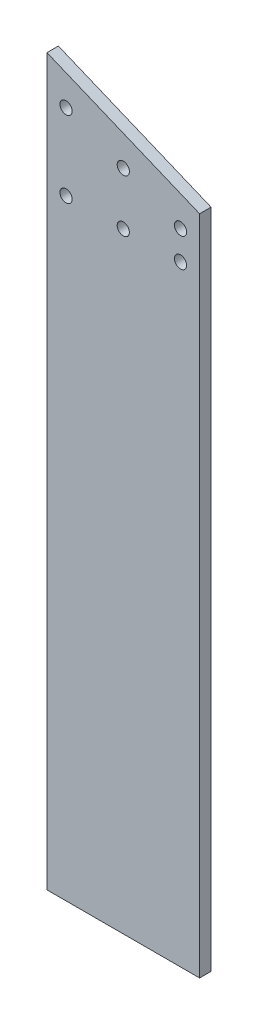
ISO-10303-21;
HEADER;
FILE_DESCRIPTION(('STEP AP214'),'2;1');
FILE_NAME('part.step','',(''),(''),'','','');
FILE_SCHEMA(('AUTOMOTIVE_DESIGN { 1 0 10303 214 1 1 1 1 }'));
ENDSEC;
DATA;
#1=APPLICATION_CONTEXT('core data for automotive mechanical design processes');
#2=APPLICATION_PROTOCOL_DEFINITION('international standard','automotive_design',2000,#1);
#3=PRODUCT_CONTEXT('',#1,'mechanical');
#4=PRODUCT('Part','Part','',(#3));
#5=PRODUCT_RELATED_PRODUCT_CATEGORY('part','',(#4));
#6=PRODUCT_DEFINITION_FORMATION('','',#4);
#7=PRODUCT_DEFINITION_CONTEXT('part definition',#1,'design');
#8=PRODUCT_DEFINITION('design','',#6,#7);
#9=PRODUCT_DEFINITION_SHAPE('','',#8);
#10=(LENGTH_UNIT() NAMED_UNIT(*) SI_UNIT(.MILLI.,.METRE.));
#11=(NAMED_UNIT(*) PLANE_ANGLE_UNIT() SI_UNIT($,.RADIAN.));
#12=(NAMED_UNIT(*) SI_UNIT($,.STERADIAN.) SOLID_ANGLE_UNIT());
#13=UNCERTAINTY_MEASURE_WITH_UNIT(LENGTH_MEASURE(1.E-05),#10,'distance_accuracy_value','');
#14=(GEOMETRIC_REPRESENTATION_CONTEXT(3) GLOBAL_UNCERTAINTY_ASSIGNED_CONTEXT((#13)) GLOBAL_UNIT_ASSIGNED_CONTEXT((#10,
#11,#12)) REPRESENTATION_CONTEXT('',''));
#15=CARTESIAN_POINT('',(0.,0.,0.));
#16=DIRECTION('',(0.,0.,1.));
#17=DIRECTION('',(1.,0.,0.));
#18=AXIS2_PLACEMENT_3D('',#15,#16,#17);
#19=CARTESIAN_POINT('',(-100.,-475.,14.9999999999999));
#20=DIRECTION('',(1.,0.,0.));
#21=DIRECTION('',(0.,0.,-1.));
#22=AXIS2_PLACEMENT_3D('',#19,#20,#21);
#23=PLANE('',#22);
#24=DIRECTION('',(0.,-1.,0.));
#25=VECTOR('',#24,1.);
#26=CARTESIAN_POINT('',(-100.,-475.,0.));
#27=LINE('',#26,#25);
#28=CARTESIAN_POINT('',(-100.,475.,0.));
#29=VERTEX_POINT('',#28);
#30=CARTESIAN_POINT('',(-100.,-475.,0.));
#31=VERTEX_POINT('',#30);
#32=EDGE_CURVE('E96',#29,#31,#27,.T.);
#33=ORIENTED_EDGE('',*,*,#32,.T.);
#34=DIRECTION('',(0.,0.,-1.));
#35=VECTOR('',#34,1.);
#36=CARTESIAN_POINT('',(-100.,-475.,14.9999999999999));
#37=LINE('',#36,#35);
#38=CARTESIAN_POINT('',(-100.,-475.,14.9999999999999));
#39=VERTEX_POINT('',#38);
#40=EDGE_CURVE('E13',#39,#31,#37,.T.);
#41=ORIENTED_EDGE('',*,*,#40,.F.);
#42=DIRECTION('',(0.,-1.,0.));
#43=VECTOR('',#42,1.);
#44=CARTESIAN_POINT('',(-100.,-475.,14.9999999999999));
#45=LINE('',#44,#43);
#46=CARTESIAN_POINT('',(-100.,475.,14.9999999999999));
#47=VERTEX_POINT('',#46);
#48=EDGE_CURVE('E107',#47,#39,#45,.T.);
#49=ORIENTED_EDGE('',*,*,#48,.F.);
#50=DIRECTION('',(0.,0.,-1.));
#51=VECTOR('',#50,1.);
#52=CARTESIAN_POINT('',(-100.,475.,14.9999999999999));
#53=LINE('',#52,#51);
#54=EDGE_CURVE('E103',#47,#29,#53,.T.);
#55=ORIENTED_EDGE('',*,*,#54,.T.);
#56=EDGE_LOOP('',(#33,#41,#49,#55));
#57=FACE_BOUND('',#56,.T.);
#58=ADVANCED_FACE('F50',(#57),#23,.F.);
#59=CARTESIAN_POINT('',(100.,-475.,14.9999999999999));
#60=DIRECTION('',(0.,1.,0.));
#61=DIRECTION('',(0.,0.,1.));
#62=AXIS2_PLACEMENT_3D('',#59,#60,#61);
#63=PLANE('',#62);
#64=DIRECTION('',(1.,0.,0.));
#65=VECTOR('',#64,1.);
#66=CARTESIAN_POINT('',(100.,-475.,0.));
#67=LINE('',#66,#65);
#68=CARTESIAN_POINT('',(100.,-475.,0.));
#69=VERTEX_POINT('',#68);
#70=EDGE_CURVE('E85',#31,#69,#67,.T.);
#71=ORIENTED_EDGE('',*,*,#70,.T.);
#72=DIRECTION('',(0.,0.,-1.));
#73=VECTOR('',#72,1.);
#74=CARTESIAN_POINT('',(100.,-475.,14.9999999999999));
#75=LINE('',#74,#73);
#76=CARTESIAN_POINT('',(100.,-475.,14.9999999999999));
#77=VERTEX_POINT('',#76);
#78=EDGE_CURVE('E58',#77,#69,#75,.T.);
#79=ORIENTED_EDGE('',*,*,#78,.F.);
#80=DIRECTION('',(1.,0.,0.));
#81=VECTOR('',#80,1.);
#82=CARTESIAN_POINT('',(100.,-475.,14.9999999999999));
#83=LINE('',#82,#81);
#84=EDGE_CURVE('E74',#39,#77,#83,.T.);
#85=ORIENTED_EDGE('',*,*,#84,.F.);
#86=ORIENTED_EDGE('',*,*,#40,.T.);
#87=EDGE_LOOP('',(#71,#79,#85,#86));
#88=FACE_BOUND('',#87,.T.);
#89=ADVANCED_FACE('F87',(#88),#63,.F.);
#90=CARTESIAN_POINT('',(100.,-475.,14.9999999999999));
#91=DIRECTION('',(-1.,0.,0.));
#92=DIRECTION('',(0.,0.,1.));
#93=AXIS2_PLACEMENT_3D('',#90,#91,#92);
#94=PLANE('',#93);
#95=DIRECTION('',(0.,1.,0.));
#96=VECTOR('',#95,1.);
#97=CARTESIAN_POINT('',(100.,-475.,0.));
#98=LINE('',#97,#96);
#99=CARTESIAN_POINT('',(100.,392.157287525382,0.));
#100=VERTEX_POINT('',#99);
#101=EDGE_CURVE('E95',#69,#100,#98,.T.);
#102=ORIENTED_EDGE('',*,*,#101,.T.);
#103=DIRECTION('',(0.,0.,1.));
#104=VECTOR('',#103,1.);
#105=CARTESIAN_POINT('',(100.,392.157287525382,0.));
#106=LINE('',#105,#104);
#107=CARTESIAN_POINT('',(100.,392.157287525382,14.9999999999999));
#108=VERTEX_POINT('',#107);
#109=EDGE_CURVE('E65',#100,#108,#106,.T.);
#110=ORIENTED_EDGE('',*,*,#109,.T.);
#111=DIRECTION('',(0.,1.,0.));
#112=VECTOR('',#111,1.);
#113=CARTESIAN_POINT('',(100.,-475.,14.9999999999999));
#114=LINE('',#113,#112);
#115=EDGE_CURVE('E101',#77,#108,#114,.T.);
#116=ORIENTED_EDGE('',*,*,#115,.F.);
#117=ORIENTED_EDGE('',*,*,#78,.T.);
#118=EDGE_LOOP('',(#102,#110,#116,#117));
#119=FACE_BOUND('',#118,.T.);
#120=ADVANCED_FACE('F100',(#119),#94,.F.);
#121=CARTESIAN_POINT('',(0.,0.,14.9999999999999));
#122=DIRECTION('',(0.,0.,1.));
#123=DIRECTION('',(1.,0.,0.));
#124=AXIS2_PLACEMENT_3D('',#121,#122,#123);
#125=PLANE('',#124);
#126=CARTESIAN_POINT('',(0.,325.,14.9999999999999));
#127=DIRECTION('',(0.,0.,1.));
#128=DIRECTION('',(1.,0.,0.));
#129=AXIS2_PLACEMENT_3D('',#126,#127,#128);
#130=CIRCLE('',#129,8.00000000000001);
#131=CARTESIAN_POINT('',(8.00000000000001,325.,14.9999999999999));
#132=VERTEX_POINT('',#131);
#133=EDGE_CURVE('E172',#132,#132,#130,.T.);
#134=ORIENTED_EDGE('',*,*,#133,.F.);
#135=EDGE_LOOP('',(#134));
#136=FACE_BOUND('',#135,.T.);
#137=CARTESIAN_POINT('',(75.,325.,14.9999999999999));
#138=DIRECTION('',(0.,0.,1.));
#139=DIRECTION('',(1.,0.,0.));
#140=AXIS2_PLACEMENT_3D('',#137,#138,#139);
#141=CIRCLE('',#140,8.00000000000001);
#142=CARTESIAN_POINT('',(83.,325.,14.9999999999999));
#143=VERTEX_POINT('',#142);
#144=EDGE_CURVE('E164',#143,#143,#141,.T.);
#145=ORIENTED_EDGE('',*,*,#144,.F.);
#146=EDGE_LOOP('',(#145));
#147=FACE_BOUND('',#146,.T.);
#148=CARTESIAN_POINT('',(-75.0000000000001,425.,14.9999999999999));
#149=DIRECTION('',(0.,0.,1.));
#150=DIRECTION('',(1.,0.,0.));
#151=AXIS2_PLACEMENT_3D('',#148,#149,#150);
#152=CIRCLE('',#151,8.00000000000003);
#153=CARTESIAN_POINT('',(-67.,425.,14.9999999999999));
#154=VERTEX_POINT('',#153);
#155=EDGE_CURVE('E156',#154,#154,#152,.T.);
#156=ORIENTED_EDGE('',*,*,#155,.F.);
#157=EDGE_LOOP('',(#156));
#158=FACE_BOUND('',#157,.T.);
#159=CARTESIAN_POINT('',(1.11022302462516E-13,393.933982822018,14.9999999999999));
#160=DIRECTION('',(0.,0.,1.));
#161=DIRECTION('',(1.,0.,0.));
#162=AXIS2_PLACEMENT_3D('',#159,#160,#161);
#163=CIRCLE('',#162,8.00000000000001);
#164=CARTESIAN_POINT('',(8.00000000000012,393.933982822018,14.9999999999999));
#165=VERTEX_POINT('',#164);
#166=EDGE_CURVE('E147',#165,#165,#163,.T.);
#167=ORIENTED_EDGE('',*,*,#166,.F.);
#168=EDGE_LOOP('',(#167));
#169=FACE_BOUND('',#168,.T.);
#170=CARTESIAN_POINT('',(75.,362.867948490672,14.9999999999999));
#171=DIRECTION('',(0.,0.,1.));
#172=DIRECTION('',(1.,0.,0.));
#173=AXIS2_PLACEMENT_3D('',#170,#171,#172);
#174=CIRCLE('',#173,8.00000000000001);
#175=CARTESIAN_POINT('',(83.,362.867948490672,14.9999999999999));
#176=VERTEX_POINT('',#175);
#177=EDGE_CURVE('E179',#176,#176,#174,.T.);
#178=ORIENTED_EDGE('',*,*,#177,.F.);
#179=EDGE_LOOP('',(#178));
#180=FACE_BOUND('',#179,.T.);
#181=CARTESIAN_POINT('',(-75.0000000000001,325.,14.9999999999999));
#182=DIRECTION('',(0.,0.,1.));
#183=DIRECTION('',(1.,0.,0.));
#184=AXIS2_PLACEMENT_3D('',#181,#182,#183);
#185=CIRCLE('',#184,8.00000000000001);
#186=CARTESIAN_POINT('',(-67.0000000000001,325.,14.9999999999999));
#187=VERTEX_POINT('',#186);
#188=EDGE_CURVE('E139',#187,#187,#185,.T.);
#189=ORIENTED_EDGE('',*,*,#188,.F.);
#190=EDGE_LOOP('',(#189));
#191=FACE_BOUND('',#190,.T.);
#192=DIRECTION('',(0.923879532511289,-0.382683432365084,0.));
#193=VECTOR('',#192,1.);
#194=CARTESIAN_POINT('',(-100.,475.,14.9999999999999));
#195=LINE('',#194,#193);
#196=EDGE_CURVE('E133',#47,#108,#195,.T.);
#197=ORIENTED_EDGE('',*,*,#196,.F.);
#198=ORIENTED_EDGE('',*,*,#48,.T.);
#199=ORIENTED_EDGE('',*,*,#84,.T.);
#200=ORIENTED_EDGE('',*,*,#115,.T.);
#201=EDGE_LOOP('',(#197,#198,#199,#200));
#202=FACE_BOUND('',#201,.T.);
#203=ADVANCED_FACE('F198',(#136,#147,#158,#169,#180,#191,#202),#125,.T.);
#204=CARTESIAN_POINT('',(0.,0.,0.));
#205=DIRECTION('',(0.,0.,1.));
#206=DIRECTION('',(1.,0.,0.));
#207=AXIS2_PLACEMENT_3D('',#204,#205,#206);
#208=PLANE('',#207);
#209=CARTESIAN_POINT('',(0.,325.,0.));
#210=DIRECTION('',(0.,0.,1.));
#211=DIRECTION('',(1.,0.,0.));
#212=AXIS2_PLACEMENT_3D('',#209,#210,#211);
#213=CIRCLE('',#212,8.00000000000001);
#214=CARTESIAN_POINT('',(8.00000000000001,325.,0.));
#215=VERTEX_POINT('',#214);
#216=EDGE_CURVE('E143',#215,#215,#213,.T.);
#217=ORIENTED_EDGE('',*,*,#216,.T.);
#218=EDGE_LOOP('',(#217));
#219=FACE_BOUND('',#218,.T.);
#220=CARTESIAN_POINT('',(75.,325.,0.));
#221=DIRECTION('',(0.,0.,1.));
#222=DIRECTION('',(1.,0.,0.));
#223=AXIS2_PLACEMENT_3D('',#220,#221,#222);
#224=CIRCLE('',#223,8.00000000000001);
#225=CARTESIAN_POINT('',(83.,325.,0.));
#226=VERTEX_POINT('',#225);
#227=EDGE_CURVE('E168',#226,#226,#224,.T.);
#228=ORIENTED_EDGE('',*,*,#227,.T.);
#229=EDGE_LOOP('',(#228));
#230=FACE_BOUND('',#229,.T.);
#231=CARTESIAN_POINT('',(-75.0000000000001,425.,0.));
#232=DIRECTION('',(0.,0.,1.));
#233=DIRECTION('',(1.,0.,0.));
#234=AXIS2_PLACEMENT_3D('',#231,#232,#233);
#235=CIRCLE('',#234,8.00000000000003);
#236=CARTESIAN_POINT('',(-67.,425.,0.));
#237=VERTEX_POINT('',#236);
#238=EDGE_CURVE('E160',#237,#237,#235,.T.);
#239=ORIENTED_EDGE('',*,*,#238,.T.);
#240=EDGE_LOOP('',(#239));
#241=FACE_BOUND('',#240,.T.);
#242=CARTESIAN_POINT('',(1.11022302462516E-13,393.933982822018,0.));
#243=DIRECTION('',(0.,0.,1.));
#244=DIRECTION('',(1.,0.,0.));
#245=AXIS2_PLACEMENT_3D('',#242,#243,#244);
#246=CIRCLE('',#245,8.00000000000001);
#247=CARTESIAN_POINT('',(8.00000000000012,393.933982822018,0.));
#248=VERTEX_POINT('',#247);
#249=EDGE_CURVE('E151',#248,#248,#246,.T.);
#250=ORIENTED_EDGE('',*,*,#249,.T.);
#251=EDGE_LOOP('',(#250));
#252=FACE_BOUND('',#251,.T.);
#253=CARTESIAN_POINT('',(75.,362.867948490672,0.));
#254=DIRECTION('',(0.,0.,1.));
#255=DIRECTION('',(1.,0.,0.));
#256=AXIS2_PLACEMENT_3D('',#253,#254,#255);
#257=CIRCLE('',#256,8.00000000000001);
#258=CARTESIAN_POINT('',(83.,362.867948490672,0.));
#259=VERTEX_POINT('',#258);
#260=EDGE_CURVE('E152',#259,#259,#257,.T.);
#261=ORIENTED_EDGE('',*,*,#260,.T.);
#262=EDGE_LOOP('',(#261));
#263=FACE_BOUND('',#262,.T.);
#264=CARTESIAN_POINT('',(-75.0000000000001,325.,0.));
#265=DIRECTION('',(0.,0.,1.));
#266=DIRECTION('',(1.,0.,0.));
#267=AXIS2_PLACEMENT_3D('',#264,#265,#266);
#268=CIRCLE('',#267,8.00000000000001);
#269=CARTESIAN_POINT('',(-67.0000000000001,325.,0.));
#270=VERTEX_POINT('',#269);
#271=EDGE_CURVE('E137',#270,#270,#268,.T.);
#272=ORIENTED_EDGE('',*,*,#271,.T.);
#273=EDGE_LOOP('',(#272));
#274=FACE_BOUND('',#273,.T.);
#275=ORIENTED_EDGE('',*,*,#32,.F.);
#276=DIRECTION('',(0.923879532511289,-0.382683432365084,0.));
#277=VECTOR('',#276,1.);
#278=CARTESIAN_POINT('',(-100.,475.,0.));
#279=LINE('',#278,#277);
#280=EDGE_CURVE('E105',#29,#100,#279,.T.);
#281=ORIENTED_EDGE('',*,*,#280,.T.);
#282=ORIENTED_EDGE('',*,*,#101,.F.);
#283=ORIENTED_EDGE('',*,*,#70,.F.);
#284=EDGE_LOOP('',(#275,#281,#282,#283));
#285=FACE_BOUND('',#284,.T.);
#286=ADVANCED_FACE('F104',(#219,#230,#241,#252,#263,#274,#285),#208,.F.);
#287=CARTESIAN_POINT('',(-100.,475.,0.));
#288=DIRECTION('',(-0.382683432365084,-0.923879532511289,0.));
#289=DIRECTION('',(0.923879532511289,-0.382683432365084,0.));
#290=AXIS2_PLACEMENT_3D('',#287,#288,#289);
#291=PLANE('',#290);
#292=ORIENTED_EDGE('',*,*,#196,.T.);
#293=ORIENTED_EDGE('',*,*,#109,.F.);
#294=ORIENTED_EDGE('',*,*,#280,.F.);
#295=ORIENTED_EDGE('',*,*,#54,.F.);
#296=EDGE_LOOP('',(#292,#293,#294,#295));
#297=FACE_BOUND('',#296,.T.);
#298=ADVANCED_FACE('F216',(#297),#291,.F.);
#299=CARTESIAN_POINT('',(-75.0000000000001,325.,0.));
#300=DIRECTION('',(0.,0.,1.));
#301=DIRECTION('',(1.,0.,0.));
#302=AXIS2_PLACEMENT_3D('',#299,#300,#301);
#303=CYLINDRICAL_SURFACE('',#302,8.00000000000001);
#304=ORIENTED_EDGE('',*,*,#271,.F.);
#305=EDGE_LOOP('',(#304));
#306=FACE_BOUND('',#305,.T.);
#307=ORIENTED_EDGE('',*,*,#188,.T.);
#308=EDGE_LOOP('',(#307));
#309=FACE_BOUND('',#308,.T.);
#310=ADVANCED_FACE('F194',(#306,#309),#303,.F.);
#311=CARTESIAN_POINT('',(75.,362.867948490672,0.));
#312=DIRECTION('',(0.,0.,1.));
#313=DIRECTION('',(1.,0.,0.));
#314=AXIS2_PLACEMENT_3D('',#311,#312,#313);
#315=CYLINDRICAL_SURFACE('',#314,8.00000000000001);
#316=ORIENTED_EDGE('',*,*,#260,.F.);
#317=EDGE_LOOP('',(#316));
#318=FACE_BOUND('',#317,.T.);
#319=ORIENTED_EDGE('',*,*,#177,.T.);
#320=EDGE_LOOP('',(#319));
#321=FACE_BOUND('',#320,.T.);
#322=ADVANCED_FACE('F190',(#318,#321),#315,.F.);
#323=CARTESIAN_POINT('',(1.11022302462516E-13,393.933982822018,0.));
#324=DIRECTION('',(0.,0.,1.));
#325=DIRECTION('',(1.,0.,0.));
#326=AXIS2_PLACEMENT_3D('',#323,#324,#325);
#327=CYLINDRICAL_SURFACE('',#326,8.00000000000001);
#328=ORIENTED_EDGE('',*,*,#249,.F.);
#329=EDGE_LOOP('',(#328));
#330=FACE_BOUND('',#329,.T.);
#331=ORIENTED_EDGE('',*,*,#166,.T.);
#332=EDGE_LOOP('',(#331));
#333=FACE_BOUND('',#332,.T.);
#334=ADVANCED_FACE('F193',(#330,#333),#327,.F.);
#335=CARTESIAN_POINT('',(-75.0000000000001,425.,0.));
#336=DIRECTION('',(0.,0.,1.));
#337=DIRECTION('',(1.,0.,0.));
#338=AXIS2_PLACEMENT_3D('',#335,#336,#337);
#339=CYLINDRICAL_SURFACE('',#338,8.00000000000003);
#340=ORIENTED_EDGE('',*,*,#238,.F.);
#341=EDGE_LOOP('',(#340));
#342=FACE_BOUND('',#341,.T.);
#343=ORIENTED_EDGE('',*,*,#155,.T.);
#344=EDGE_LOOP('',(#343));
#345=FACE_BOUND('',#344,.T.);
#346=ADVANCED_FACE('F226',(#342,#345),#339,.F.);
#347=CARTESIAN_POINT('',(75.,325.,0.));
#348=DIRECTION('',(0.,0.,1.));
#349=DIRECTION('',(1.,0.,0.));
#350=AXIS2_PLACEMENT_3D('',#347,#348,#349);
#351=CYLINDRICAL_SURFACE('',#350,8.00000000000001);
#352=ORIENTED_EDGE('',*,*,#227,.F.);
#353=EDGE_LOOP('',(#352));
#354=FACE_BOUND('',#353,.T.);
#355=ORIENTED_EDGE('',*,*,#144,.T.);
#356=EDGE_LOOP('',(#355));
#357=FACE_BOUND('',#356,.T.);
#358=ADVANCED_FACE('F230',(#354,#357),#351,.F.);
#359=CARTESIAN_POINT('',(0.,325.,0.));
#360=DIRECTION('',(0.,0.,1.));
#361=DIRECTION('',(1.,0.,0.));
#362=AXIS2_PLACEMENT_3D('',#359,#360,#361);
#363=CYLINDRICAL_SURFACE('',#362,8.00000000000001);
#364=ORIENTED_EDGE('',*,*,#216,.F.);
#365=EDGE_LOOP('',(#364));
#366=FACE_BOUND('',#365,.T.);
#367=ORIENTED_EDGE('',*,*,#133,.T.);
#368=EDGE_LOOP('',(#367));
#369=FACE_BOUND('',#368,.T.);
#370=ADVANCED_FACE('F234',(#366,#369),#363,.F.);
#371=CLOSED_SHELL('',(#58,#89,#120,#203,#286,#298,#310,#322,#334,#346,#358,#370));
#372=MANIFOLD_SOLID_BREP('B2',#371);
#373=ADVANCED_BREP_SHAPE_REPRESENTATION('',(#18,#372),#14);
#374=SHAPE_DEFINITION_REPRESENTATION(#9,#373);
ENDSEC;
END-ISO-10303-21;
